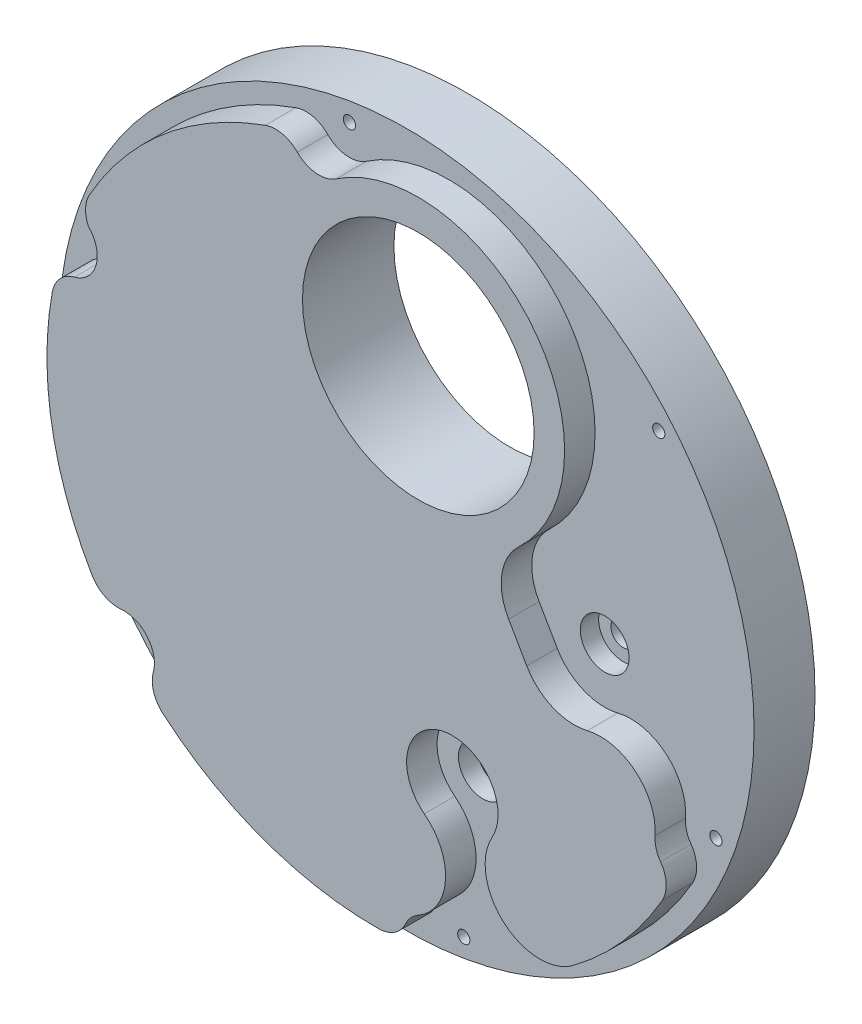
ISO-10303-21;
HEADER;
FILE_DESCRIPTION(('STEP AP214'),'2;1');
FILE_NAME('part.step','',(''),(''),'','','');
FILE_SCHEMA(('AUTOMOTIVE_DESIGN { 1 0 10303 214 1 1 1 1 }'));
ENDSEC;
DATA;
#1=APPLICATION_CONTEXT('core data for automotive mechanical design processes');
#2=APPLICATION_PROTOCOL_DEFINITION('international standard','automotive_design',2000,#1);
#3=PRODUCT_CONTEXT('',#1,'mechanical');
#4=PRODUCT('Part','Part','',(#3));
#5=PRODUCT_RELATED_PRODUCT_CATEGORY('part','',(#4));
#6=PRODUCT_DEFINITION_FORMATION('','',#4);
#7=PRODUCT_DEFINITION_CONTEXT('part definition',#1,'design');
#8=PRODUCT_DEFINITION('design','',#6,#7);
#9=PRODUCT_DEFINITION_SHAPE('','',#8);
#10=(LENGTH_UNIT() NAMED_UNIT(*) SI_UNIT(.MILLI.,.METRE.));
#11=(NAMED_UNIT(*) PLANE_ANGLE_UNIT() SI_UNIT($,.RADIAN.));
#12=(NAMED_UNIT(*) SI_UNIT($,.STERADIAN.) SOLID_ANGLE_UNIT());
#13=UNCERTAINTY_MEASURE_WITH_UNIT(LENGTH_MEASURE(1.E-05),#10,'distance_accuracy_value','');
#14=(GEOMETRIC_REPRESENTATION_CONTEXT(3) GLOBAL_UNCERTAINTY_ASSIGNED_CONTEXT((#13)) GLOBAL_UNIT_ASSIGNED_CONTEXT((#10,
#11,#12)) REPRESENTATION_CONTEXT('',''));
#15=CARTESIAN_POINT('',(0.,0.,0.));
#16=DIRECTION('',(0.,0.,1.));
#17=DIRECTION('',(1.,0.,0.));
#18=AXIS2_PLACEMENT_3D('',#15,#16,#17);
#19=CARTESIAN_POINT('',(12.5,-28.,0.));
#20=DIRECTION('',(0.,0.,1.));
#21=DIRECTION('',(1.,0.,0.));
#22=AXIS2_PLACEMENT_3D('',#19,#20,#21);
#23=CYLINDRICAL_SURFACE('',#22,2.);
#24=CARTESIAN_POINT('',(12.5,-28.,0.));
#25=DIRECTION('',(0.,0.,1.));
#26=DIRECTION('',(1.,0.,0.));
#27=AXIS2_PLACEMENT_3D('',#24,#25,#26);
#28=CIRCLE('',#27,2.);
#29=CARTESIAN_POINT('',(14.5,-28.,0.));
#30=VERTEX_POINT('',#29);
#31=EDGE_CURVE('E377',#30,#30,#28,.T.);
#32=ORIENTED_EDGE('',*,*,#31,.F.);
#33=EDGE_LOOP('',(#32));
#34=FACE_BOUND('',#33,.T.);
#35=CARTESIAN_POINT('',(12.5,-28.,7.));
#36=DIRECTION('',(0.,0.,1.));
#37=DIRECTION('',(1.,0.,0.));
#38=AXIS2_PLACEMENT_3D('',#35,#36,#37);
#39=CIRCLE('',#38,2.);
#40=CARTESIAN_POINT('',(14.5,-28.,7.));
#41=VERTEX_POINT('',#40);
#42=EDGE_CURVE('E37',#41,#41,#39,.F.);
#43=ORIENTED_EDGE('',*,*,#42,.F.);
#44=EDGE_LOOP('',(#43));
#45=FACE_BOUND('',#44,.T.);
#46=ADVANCED_FACE('F33',(#34,#45),#23,.F.);
#47=CARTESIAN_POINT('',(32.5,0.,0.));
#48=DIRECTION('',(0.,0.,1.));
#49=DIRECTION('',(1.,0.,0.));
#50=AXIS2_PLACEMENT_3D('',#47,#48,#49);
#51=CYLINDRICAL_SURFACE('',#50,2.);
#52=CARTESIAN_POINT('',(32.5,0.,0.));
#53=DIRECTION('',(0.,0.,1.));
#54=DIRECTION('',(1.,0.,0.));
#55=AXIS2_PLACEMENT_3D('',#52,#53,#54);
#56=CIRCLE('',#55,2.);
#57=CARTESIAN_POINT('',(34.5,0.,0.));
#58=VERTEX_POINT('',#57);
#59=EDGE_CURVE('E382',#58,#58,#56,.T.);
#60=ORIENTED_EDGE('',*,*,#59,.F.);
#61=EDGE_LOOP('',(#60));
#62=FACE_BOUND('',#61,.T.);
#63=CARTESIAN_POINT('',(32.5,0.,7.));
#64=DIRECTION('',(0.,0.,1.));
#65=DIRECTION('',(1.,0.,0.));
#66=AXIS2_PLACEMENT_3D('',#63,#64,#65);
#67=CIRCLE('',#66,2.);
#68=CARTESIAN_POINT('',(34.5,0.,7.));
#69=VERTEX_POINT('',#68);
#70=EDGE_CURVE('E375',#69,#69,#67,.F.);
#71=ORIENTED_EDGE('',*,*,#70,.F.);
#72=EDGE_LOOP('',(#71));
#73=FACE_BOUND('',#72,.T.);
#74=ADVANCED_FACE('F470',(#62,#73),#51,.F.);
#75=CARTESIAN_POINT('',(0.,0.,10.));
#76=DIRECTION('',(0.,0.,1.));
#77=DIRECTION('',(1.,0.,0.));
#78=AXIS2_PLACEMENT_3D('',#75,#76,#77);
#79=PLANE('',#78);
#80=CARTESIAN_POINT('',(12.5,-28.,10.));
#81=DIRECTION('',(0.,0.,1.));
#82=DIRECTION('',(1.,0.,0.));
#83=AXIS2_PLACEMENT_3D('',#80,#81,#82);
#84=CIRCLE('',#83,4.);
#85=CARTESIAN_POINT('',(16.5,-28.,10.));
#86=VERTEX_POINT('',#85);
#87=EDGE_CURVE('E392',#86,#86,#84,.T.);
#88=ORIENTED_EDGE('',*,*,#87,.F.);
#89=EDGE_LOOP('',(#88));
#90=FACE_BOUND('',#89,.T.);
#91=CARTESIAN_POINT('',(32.5,0.,10.));
#92=DIRECTION('',(0.,0.,1.));
#93=DIRECTION('',(1.,0.,0.));
#94=AXIS2_PLACEMENT_3D('',#91,#92,#93);
#95=CIRCLE('',#94,4.00000000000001);
#96=CARTESIAN_POINT('',(36.5,0.,10.));
#97=VERTEX_POINT('',#96);
#98=EDGE_CURVE('E385',#97,#97,#95,.T.);
#99=ORIENTED_EDGE('',*,*,#98,.F.);
#100=EDGE_LOOP('',(#99));
#101=FACE_BOUND('',#100,.T.);
#102=CARTESIAN_POINT('',(0.,0.,10.));
#103=DIRECTION('',(0.,0.,1.));
#104=DIRECTION('',(1.,0.,0.));
#105=AXIS2_PLACEMENT_3D('',#102,#103,#104);
#106=CIRCLE('',#105,57.);
#107=CARTESIAN_POINT('',(57.,0.,10.));
#108=VERTEX_POINT('',#107);
#109=EDGE_CURVE('E11',#108,#108,#106,.T.);
#110=ORIENTED_EDGE('',*,*,#109,.T.);
#111=EDGE_LOOP('',(#110));
#112=FACE_BOUND('',#111,.T.);
#113=CARTESIAN_POINT('',(-50.7434015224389,18.4690877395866,10.));
#114=DIRECTION('',(0.,0.,1.));
#115=DIRECTION('',(1.,0.,0.));
#116=AXIS2_PLACEMENT_3D('',#113,#114,#115);
#117=CIRCLE('',#116,0.999999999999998);
#118=CARTESIAN_POINT('',(-49.7434015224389,18.4690877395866,10.));
#119=VERTEX_POINT('',#118);
#120=EDGE_CURVE('E366',#119,#119,#117,.T.);
#121=ORIENTED_EDGE('',*,*,#120,.F.);
#122=EDGE_LOOP('',(#121));
#123=FACE_BOUND('',#122,.T.);
#124=CARTESIAN_POINT('',(-9.37700159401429,53.1796186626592,10.));
#125=DIRECTION('',(0.,0.,1.));
#126=DIRECTION('',(1.,0.,0.));
#127=AXIS2_PLACEMENT_3D('',#124,#125,#126);
#128=CIRCLE('',#127,1.);
#129=CARTESIAN_POINT('',(-8.37700159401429,53.1796186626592,10.));
#130=VERTEX_POINT('',#129);
#131=EDGE_CURVE('E360',#130,#130,#128,.T.);
#132=ORIENTED_EDGE('',*,*,#131,.F.);
#133=EDGE_LOOP('',(#132));
#134=FACE_BOUND('',#133,.T.);
#135=CARTESIAN_POINT('',(-41.3663999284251,-34.7105309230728,10.));
#136=DIRECTION('',(0.,0.,1.));
#137=DIRECTION('',(1.,0.,0.));
#138=AXIS2_PLACEMENT_3D('',#135,#136,#137);
#139=CIRCLE('',#138,0.999999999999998);
#140=CARTESIAN_POINT('',(-40.3663999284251,-34.7105309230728,10.));
#141=VERTEX_POINT('',#140);
#142=EDGE_CURVE('E354',#141,#141,#139,.T.);
#143=ORIENTED_EDGE('',*,*,#142,.F.);
#144=EDGE_LOOP('',(#143));
#145=FACE_BOUND('',#144,.T.);
#146=CARTESIAN_POINT('',(9.37700159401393,-53.1796186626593,10.));
#147=DIRECTION('',(0.,0.,1.));
#148=DIRECTION('',(1.,0.,0.));
#149=AXIS2_PLACEMENT_3D('',#146,#147,#148);
#150=CIRCLE('',#149,1.);
#151=CARTESIAN_POINT('',(10.3770015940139,-53.1796186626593,10.));
#152=VERTEX_POINT('',#151);
#153=EDGE_CURVE('E348',#152,#152,#150,.T.);
#154=ORIENTED_EDGE('',*,*,#153,.F.);
#155=EDGE_LOOP('',(#154));
#156=FACE_BOUND('',#155,.T.);
#157=CARTESIAN_POINT('',(50.743401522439,-18.4690877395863,10.));
#158=DIRECTION('',(0.,0.,1.));
#159=DIRECTION('',(1.,0.,0.));
#160=AXIS2_PLACEMENT_3D('',#157,#158,#159);
#161=CIRCLE('',#160,0.999999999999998);
#162=CARTESIAN_POINT('',(51.743401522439,-18.4690877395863,10.));
#163=VERTEX_POINT('',#162);
#164=EDGE_CURVE('E342',#163,#163,#161,.T.);
#165=ORIENTED_EDGE('',*,*,#164,.F.);
#166=EDGE_LOOP('',(#165));
#167=FACE_BOUND('',#166,.T.);
#168=CARTESIAN_POINT('',(41.3663999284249,34.7105309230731,10.));
#169=DIRECTION('',(0.,0.,1.));
#170=DIRECTION('',(1.,0.,0.));
#171=AXIS2_PLACEMENT_3D('',#168,#169,#170);
#172=CIRCLE('',#171,0.999999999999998);
#173=CARTESIAN_POINT('',(42.3663999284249,34.7105309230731,10.));
#174=VERTEX_POINT('',#173);
#175=EDGE_CURVE('E338',#174,#174,#172,.T.);
#176=ORIENTED_EDGE('',*,*,#175,.F.);
#177=EDGE_LOOP('',(#176));
#178=FACE_BOUND('',#177,.T.);
#179=CARTESIAN_POINT('',(-42.6661219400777,24.0956850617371,10.));
#180=DIRECTION('',(0.,0.,1.));
#181=DIRECTION('',(1.,0.,0.));
#182=AXIS2_PLACEMENT_3D('',#179,#180,#181);
#183=CIRCLE('',#182,4.99999999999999);
#184=CARTESIAN_POINT('',(-47.0198078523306,26.5544284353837,10.));
#185=VERTEX_POINT('',#184);
#186=CARTESIAN_POINT('',(-47.2078676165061,22.0046216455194,10.));
#187=VERTEX_POINT('',#186);
#188=EDGE_CURVE('E230',#185,#187,#183,.T.);
#189=ORIENTED_EDGE('',*,*,#188,.F.);
#190=CARTESIAN_POINT('',(0.,0.,10.));
#191=DIRECTION('',(0.,0.,1.));
#192=DIRECTION('',(1.,0.,0.));
#193=AXIS2_PLACEMENT_3D('',#190,#191,#192);
#194=CIRCLE('',#193,54.);
#195=CARTESIAN_POINT('',(-18.1655835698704,50.8528423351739,10.));
#196=VERTEX_POINT('',#195);
#197=EDGE_CURVE('E227',#196,#185,#194,.T.);
#198=ORIENTED_EDGE('',*,*,#197,.F.);
#199=CARTESIAN_POINT('',(-16.4835850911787,46.1442458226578,10.));
#200=DIRECTION('',(0.,0.,1.));
#201=DIRECTION('',(-1.,0.,0.));
#202=AXIS2_PLACEMENT_3D('',#199,#200,#201);
#203=CIRCLE('',#202,5.);
#204=CARTESIAN_POINT('',(-12.9302933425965,49.6619322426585,10.));
#205=VERTEX_POINT('',#204);
#206=EDGE_CURVE('E132',#205,#196,#203,.T.);
#207=ORIENTED_EDGE('',*,*,#206,.F.);
#208=CARTESIAN_POINT('',(-9.37700159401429,53.1796186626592,10.));
#209=DIRECTION('',(0.,0.,-1.));
#210=DIRECTION('',(1.,0.,0.));
#211=AXIS2_PLACEMENT_3D('',#208,#209,#210);
#212=CIRCLE('',#211,4.99999999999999);
#213=CARTESIAN_POINT('',(-6.56735730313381,49.0436908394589,10.));
#214=VERTEX_POINT('',#213);
#215=EDGE_CURVE('E272',#214,#205,#212,.T.);
#216=ORIENTED_EDGE('',*,*,#215,.F.);
#217=CARTESIAN_POINT('',(6.9189352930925,29.1912372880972,10.));
#218=DIRECTION('',(0.,0.,1.));
#219=DIRECTION('',(-1.,0.,0.));
#220=AXIS2_PLACEMENT_3D('',#217,#218,#219);
#221=CIRCLE('',#220,24.);
#222=CARTESIAN_POINT('',(23.3603992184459,11.7075802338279,10.));
#223=VERTEX_POINT('',#222);
#224=EDGE_CURVE('E216',#223,#214,#221,.T.);
#225=ORIENTED_EDGE('',*,*,#224,.F.);
#226=CARTESIAN_POINT('',(29.5259481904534,5.15120883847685,10.));
#227=DIRECTION('',(0.,0.,-1.));
#228=DIRECTION('',(1.,0.,0.));
#229=AXIS2_PLACEMENT_3D('',#226,#227,#228);
#230=CIRCLE('',#229,9.);
#231=CARTESIAN_POINT('',(21.7317195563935,0.651208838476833,10.));
#232=VERTEX_POINT('',#231);
#233=EDGE_CURVE('E269',#232,#223,#230,.T.);
#234=ORIENTED_EDGE('',*,*,#233,.F.);
#235=DIRECTION('',(-0.500000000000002,0.866025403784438,0.));
#236=VECTOR('',#235,1.);
#237=CARTESIAN_POINT('',(21.7317195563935,0.65120883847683,10.));
#238=LINE('',#237,#236);
#239=CARTESIAN_POINT('',(24.7057713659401,-4.50000000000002,10.));
#240=VERTEX_POINT('',#239);
#241=EDGE_CURVE('E267',#240,#232,#238,.T.);
#242=ORIENTED_EDGE('',*,*,#241,.F.);
#243=CARTESIAN_POINT('',(32.5,0.,10.));
#244=DIRECTION('',(0.,0.,-1.));
#245=DIRECTION('',(1.,0.,0.));
#246=AXIS2_PLACEMENT_3D('',#243,#244,#245);
#247=CIRCLE('',#246,9.);
#248=CARTESIAN_POINT('',(34.639043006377,-8.74211044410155,10.));
#249=VERTEX_POINT('',#248);
#250=EDGE_CURVE('E265',#249,#240,#247,.T.);
#251=ORIENTED_EDGE('',*,*,#250,.F.);
#252=CARTESIAN_POINT('',(36.7780860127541,-17.4842208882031,10.));
#253=DIRECTION('',(0.,0.,1.));
#254=DIRECTION('',(-1.,0.,0.));
#255=AXIS2_PLACEMENT_3D('',#252,#253,#254);
#256=CIRCLE('',#255,8.99999999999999);
#257=CARTESIAN_POINT('',(45.7557888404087,-18.117349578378,10.));
#258=VERTEX_POINT('',#257);
#259=EDGE_CURVE('E263',#258,#249,#256,.T.);
#260=ORIENTED_EDGE('',*,*,#259,.F.);
#261=CARTESIAN_POINT('',(50.743401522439,-18.4690877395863,10.));
#262=DIRECTION('',(0.,0.,-1.));
#263=DIRECTION('',(1.,0.,0.));
#264=AXIS2_PLACEMENT_3D('',#261,#262,#263);
#265=CIRCLE('',#264,5.00000000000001);
#266=CARTESIAN_POINT('',(46.6621340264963,-21.3575571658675,10.));
#267=VERTEX_POINT('',#266);
#268=EDGE_CURVE('E261',#267,#258,#265,.T.);
#269=ORIENTED_EDGE('',*,*,#268,.F.);
#270=CARTESIAN_POINT('',(42.5808665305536,-24.2460265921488,10.));
#271=DIRECTION('',(0.,0.,1.));
#272=DIRECTION('',(-1.,0.,0.));
#273=AXIS2_PLACEMENT_3D('',#270,#271,#272);
#274=CIRCLE('',#273,5.);
#275=CARTESIAN_POINT('',(46.9258529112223,-26.7201109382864,10.));
#276=VERTEX_POINT('',#275);
#277=EDGE_CURVE('E259',#276,#267,#274,.T.);
#278=ORIENTED_EDGE('',*,*,#277,.F.);
#279=CARTESIAN_POINT('',(0.,0.,10.));
#280=DIRECTION('',(0.,0.,1.));
#281=DIRECTION('',(1.,0.,0.));
#282=AXIS2_PLACEMENT_3D('',#279,#280,#281);
#283=CIRCLE('',#282,54.);
#284=CARTESIAN_POINT('',(32.2576188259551,-43.3064201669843,10.));
#285=VERTEX_POINT('',#284);
#286=EDGE_CURVE('E257',#285,#276,#283,.T.);
#287=ORIENTED_EDGE('',*,*,#286,.F.);
#288=CARTESIAN_POINT('',(26.8813490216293,-36.0886834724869,10.));
#289=DIRECTION('',(0.,0.,1.));
#290=DIRECTION('',(-1.,0.,0.));
#291=AXIS2_PLACEMENT_3D('',#288,#289,#290);
#292=CIRCLE('',#291,8.99999999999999);
#293=CARTESIAN_POINT('',(19.0369768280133,-31.6766743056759,10.));
#294=VERTEX_POINT('',#293);
#295=EDGE_CURVE('E255',#294,#285,#292,.T.);
#296=ORIENTED_EDGE('',*,*,#295,.F.);
#297=CARTESIAN_POINT('',(12.5,-28.,10.));
#298=DIRECTION('',(0.,0.,-1.));
#299=DIRECTION('',(1.,0.,0.));
#300=AXIS2_PLACEMENT_3D('',#297,#298,#299);
#301=CIRCLE('',#300,7.5);
#302=CARTESIAN_POINT('',(7.90720749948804,-33.9292712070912,10.));
#303=VERTEX_POINT('',#302);
#304=EDGE_CURVE('E253',#303,#294,#301,.T.);
#305=ORIENTED_EDGE('',*,*,#304,.F.);
#306=CARTESIAN_POINT('',(2.39585649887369,-41.0443966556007,10.));
#307=DIRECTION('',(0.,0.,1.));
#308=DIRECTION('',(-1.,0.,0.));
#309=AXIS2_PLACEMENT_3D('',#306,#307,#308);
#310=CIRCLE('',#309,9.);
#311=CARTESIAN_POINT('',(6.8837354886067,-48.8456108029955,10.));
#312=VERTEX_POINT('',#311);
#313=EDGE_CURVE('E251',#312,#303,#310,.T.);
#314=ORIENTED_EDGE('',*,*,#313,.F.);
#315=CARTESIAN_POINT('',(9.37700159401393,-53.1796186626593,10.));
#316=DIRECTION('',(0.,0.,-1.));
#317=DIRECTION('',(1.,0.,0.));
#318=AXIS2_PLACEMENT_3D('',#315,#316,#317);
#319=CIRCLE('',#318,5.);
#320=CARTESIAN_POINT('',(4.83487994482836,-51.0893720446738,10.));
#321=VERTEX_POINT('',#320);
#322=EDGE_CURVE('E249',#321,#312,#319,.T.);
#323=ORIENTED_EDGE('',*,*,#322,.F.);
#324=CARTESIAN_POINT('',(0.29275829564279,-48.9991254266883,10.));
#325=DIRECTION('',(0.,0.,1.));
#326=DIRECTION('',(-1.,0.,0.));
#327=AXIS2_PLACEMENT_3D('',#324,#325,#326);
#328=CIRCLE('',#327,4.99999999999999);
#329=CARTESIAN_POINT('',(0.322631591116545,-53.9990361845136,10.));
#330=VERTEX_POINT('',#329);
#331=EDGE_CURVE('E247',#330,#321,#328,.T.);
#332=ORIENTED_EDGE('',*,*,#331,.F.);
#333=CARTESIAN_POINT('',(0.,0.,10.));
#334=DIRECTION('',(0.,0.,1.));
#335=DIRECTION('',(1.,0.,0.));
#336=AXIS2_PLACEMENT_3D('',#333,#334,#335);
#337=CIRCLE('',#336,54.);
#338=CARTESIAN_POINT('',(-34.9570615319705,-41.1582780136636,10.));
#339=VERTEX_POINT('',#338);
#340=EDGE_CURVE('E245',#339,#330,#337,.T.);
#341=ORIENTED_EDGE('',*,*,#340,.F.);
#342=CARTESIAN_POINT('',(-31.7202965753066,-37.3473263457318,10.));
#343=DIRECTION('',(0.,0.,1.));
#344=DIRECTION('',(1.,0.,0.));
#345=AXIS2_PLACEMENT_3D('',#342,#343,#344);
#346=CIRCLE('',#345,5.);
#347=CARTESIAN_POINT('',(-36.5433482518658,-36.0289286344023,10.));
#348=VERTEX_POINT('',#347);
#349=EDGE_CURVE('E243',#348,#339,#346,.T.);
#350=ORIENTED_EDGE('',*,*,#349,.F.);
#351=CARTESIAN_POINT('',(-41.3663999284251,-34.7105309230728,10.));
#352=DIRECTION('',(0.,0.,-1.));
#353=DIRECTION('',(-1.,0.,0.));
#354=AXIS2_PLACEMENT_3D('',#351,#352,#353);
#355=CIRCLE('',#354,5.);
#356=CARTESIAN_POINT('',(-41.8272540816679,-29.7318148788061,10.));
#357=VERTEX_POINT('',#356);
#358=EDGE_CURVE('E241',#357,#348,#355,.T.);
#359=ORIENTED_EDGE('',*,*,#358,.F.);
#360=CARTESIAN_POINT('',(-42.2881082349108,-24.7530988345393,10.));
#361=DIRECTION('',(0.,0.,1.));
#362=DIRECTION('',(1.,0.,0.));
#363=AXIS2_PLACEMENT_3D('',#360,#361,#362);
#364=CIRCLE('',#363,5.);
#365=CARTESIAN_POINT('',(-46.6032213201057,-27.278925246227,10.));
#366=VERTEX_POINT('',#365);
#367=EDGE_CURVE('E239',#366,#357,#364,.T.);
#368=ORIENTED_EDGE('',*,*,#367,.F.);
#369=CARTESIAN_POINT('',(0.,0.,10.));
#370=DIRECTION('',(0.,0.,1.));
#371=DIRECTION('',(1.,0.,0.));
#372=AXIS2_PLACEMENT_3D('',#369,#370,#371);
#373=CIRCLE('',#372,54.);
#374=CARTESIAN_POINT('',(-53.1226451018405,9.69456432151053,10.));
#375=VERTEX_POINT('',#374);
#376=EDGE_CURVE('E237',#375,#366,#373,.T.);
#377=ORIENTED_EDGE('',*,*,#376,.F.);
#378=CARTESIAN_POINT('',(-48.2038816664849,8.79691947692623,10.));
#379=DIRECTION('',(0.,0.,1.));
#380=DIRECTION('',(1.,0.,0.));
#381=AXIS2_PLACEMENT_3D('',#378,#379,#380);
#382=CIRCLE('',#381,5.);
#383=CARTESIAN_POINT('',(-49.4736415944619,13.6330036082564,10.));
#384=VERTEX_POINT('',#383);
#385=EDGE_CURVE('E235',#384,#375,#382,.T.);
#386=ORIENTED_EDGE('',*,*,#385,.F.);
#387=CARTESIAN_POINT('',(-50.7434015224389,18.4690877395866,10.));
#388=DIRECTION('',(0.,0.,-1.));
#389=DIRECTION('',(-1.,0.,0.));
#390=AXIS2_PLACEMENT_3D('',#387,#388,#389);
#391=CIRCLE('',#390,5.);
#392=EDGE_CURVE('E233',#187,#384,#391,.T.);
#393=ORIENTED_EDGE('',*,*,#392,.F.);
#394=EDGE_LOOP('',(#189,#198,#207,#216,#225,#234,#242,#251,#260,#269,#278,#287,#296,#305,#314,
#323,#332,#341,#350,#359,#368,#377,#386,#393));
#395=FACE_BOUND('',#394,.T.);
#396=ADVANCED_FACE('F451',(#90,#101,#112,#123,#134,#145,#156,#167,#178,#395),#79,.T.);
#397=CARTESIAN_POINT('',(0.,0.,10.));
#398=DIRECTION('',(0.,0.,-1.));
#399=DIRECTION('',(-1.,0.,0.));
#400=AXIS2_PLACEMENT_3D('',#397,#398,#399);
#401=CYLINDRICAL_SURFACE('',#400,57.);
#402=ORIENTED_EDGE('',*,*,#109,.F.);
#403=EDGE_LOOP('',(#402));
#404=FACE_BOUND('',#403,.T.);
#405=CARTESIAN_POINT('',(0.,0.,0.));
#406=DIRECTION('',(0.,0.,1.));
#407=DIRECTION('',(1.,0.,0.));
#408=AXIS2_PLACEMENT_3D('',#405,#406,#407);
#409=CIRCLE('',#408,57.);
#410=CARTESIAN_POINT('',(57.,0.,0.));
#411=VERTEX_POINT('',#410);
#412=EDGE_CURVE('E42',#411,#411,#409,.T.);
#413=ORIENTED_EDGE('',*,*,#412,.T.);
#414=EDGE_LOOP('',(#413));
#415=FACE_BOUND('',#414,.T.);
#416=ADVANCED_FACE('F35',(#404,#415),#401,.T.);
#417=CARTESIAN_POINT('',(0.,0.,0.));
#418=DIRECTION('',(0.,0.,1.));
#419=DIRECTION('',(1.,0.,0.));
#420=AXIS2_PLACEMENT_3D('',#417,#418,#419);
#421=PLANE('',#420);
#422=ORIENTED_EDGE('',*,*,#31,.T.);
#423=EDGE_LOOP('',(#422));
#424=FACE_BOUND('',#423,.T.);
#425=ORIENTED_EDGE('',*,*,#59,.T.);
#426=EDGE_LOOP('',(#425));
#427=FACE_BOUND('',#426,.T.);
#428=CARTESIAN_POINT('',(6.9189352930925,29.1912372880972,0.));
#429=DIRECTION('',(0.,0.,1.));
#430=DIRECTION('',(1.,0.,0.));
#431=AXIS2_PLACEMENT_3D('',#428,#429,#430);
#432=CIRCLE('',#431,19.);
#433=CARTESIAN_POINT('',(25.9189352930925,29.1912372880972,0.));
#434=VERTEX_POINT('',#433);
#435=EDGE_CURVE('E231',#434,#434,#432,.T.);
#436=ORIENTED_EDGE('',*,*,#435,.T.);
#437=EDGE_LOOP('',(#436));
#438=FACE_BOUND('',#437,.T.);
#439=CARTESIAN_POINT('',(41.3663999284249,34.7105309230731,0.));
#440=DIRECTION('',(0.,0.,1.));
#441=DIRECTION('',(1.,0.,0.));
#442=AXIS2_PLACEMENT_3D('',#439,#440,#441);
#443=CIRCLE('',#442,0.999999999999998);
#444=CARTESIAN_POINT('',(42.3663999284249,34.7105309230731,0.));
#445=VERTEX_POINT('',#444);
#446=EDGE_CURVE('E339',#445,#445,#443,.T.);
#447=ORIENTED_EDGE('',*,*,#446,.T.);
#448=EDGE_LOOP('',(#447));
#449=FACE_BOUND('',#448,.T.);
#450=CARTESIAN_POINT('',(50.743401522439,-18.4690877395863,0.));
#451=DIRECTION('',(0.,0.,1.));
#452=DIRECTION('',(1.,0.,0.));
#453=AXIS2_PLACEMENT_3D('',#450,#451,#452);
#454=CIRCLE('',#453,0.999999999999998);
#455=CARTESIAN_POINT('',(51.743401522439,-18.4690877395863,0.));
#456=VERTEX_POINT('',#455);
#457=EDGE_CURVE('E345',#456,#456,#454,.T.);
#458=ORIENTED_EDGE('',*,*,#457,.T.);
#459=EDGE_LOOP('',(#458));
#460=FACE_BOUND('',#459,.T.);
#461=CARTESIAN_POINT('',(9.37700159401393,-53.1796186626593,0.));
#462=DIRECTION('',(0.,0.,1.));
#463=DIRECTION('',(1.,0.,0.));
#464=AXIS2_PLACEMENT_3D('',#461,#462,#463);
#465=CIRCLE('',#464,1.);
#466=CARTESIAN_POINT('',(10.3770015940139,-53.1796186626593,0.));
#467=VERTEX_POINT('',#466);
#468=EDGE_CURVE('E351',#467,#467,#465,.T.);
#469=ORIENTED_EDGE('',*,*,#468,.T.);
#470=EDGE_LOOP('',(#469));
#471=FACE_BOUND('',#470,.T.);
#472=CARTESIAN_POINT('',(-41.3663999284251,-34.7105309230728,0.));
#473=DIRECTION('',(0.,0.,1.));
#474=DIRECTION('',(1.,0.,0.));
#475=AXIS2_PLACEMENT_3D('',#472,#473,#474);
#476=CIRCLE('',#475,0.999999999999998);
#477=CARTESIAN_POINT('',(-40.3663999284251,-34.7105309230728,0.));
#478=VERTEX_POINT('',#477);
#479=EDGE_CURVE('E357',#478,#478,#476,.T.);
#480=ORIENTED_EDGE('',*,*,#479,.T.);
#481=EDGE_LOOP('',(#480));
#482=FACE_BOUND('',#481,.T.);
#483=CARTESIAN_POINT('',(-9.37700159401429,53.1796186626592,0.));
#484=DIRECTION('',(0.,0.,1.));
#485=DIRECTION('',(1.,0.,0.));
#486=AXIS2_PLACEMENT_3D('',#483,#484,#485);
#487=CIRCLE('',#486,1.);
#488=CARTESIAN_POINT('',(-8.37700159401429,53.1796186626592,0.));
#489=VERTEX_POINT('',#488);
#490=EDGE_CURVE('E363',#489,#489,#487,.T.);
#491=ORIENTED_EDGE('',*,*,#490,.T.);
#492=EDGE_LOOP('',(#491));
#493=FACE_BOUND('',#492,.T.);
#494=CARTESIAN_POINT('',(-50.7434015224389,18.4690877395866,0.));
#495=DIRECTION('',(0.,0.,1.));
#496=DIRECTION('',(1.,0.,0.));
#497=AXIS2_PLACEMENT_3D('',#494,#495,#496);
#498=CIRCLE('',#497,0.999999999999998);
#499=CARTESIAN_POINT('',(-49.7434015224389,18.4690877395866,0.));
#500=VERTEX_POINT('',#499);
#501=EDGE_CURVE('E369',#500,#500,#498,.T.);
#502=ORIENTED_EDGE('',*,*,#501,.T.);
#503=EDGE_LOOP('',(#502));
#504=FACE_BOUND('',#503,.T.);
#505=ORIENTED_EDGE('',*,*,#412,.F.);
#506=EDGE_LOOP('',(#505));
#507=FACE_BOUND('',#506,.T.);
#508=ADVANCED_FACE('F494',(#424,#427,#438,#449,#460,#471,#482,#493,#504,#507),#421,.F.);
#509=CARTESIAN_POINT('',(-50.7434015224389,18.4690877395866,0.));
#510=DIRECTION('',(0.,0.,1.));
#511=DIRECTION('',(1.,0.,0.));
#512=AXIS2_PLACEMENT_3D('',#509,#510,#511);
#513=CYLINDRICAL_SURFACE('',#512,0.999999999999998);
#514=ORIENTED_EDGE('',*,*,#501,.F.);
#515=EDGE_LOOP('',(#514));
#516=FACE_BOUND('',#515,.T.);
#517=ORIENTED_EDGE('',*,*,#120,.T.);
#518=EDGE_LOOP('',(#517));
#519=FACE_BOUND('',#518,.T.);
#520=ADVANCED_FACE('F497',(#516,#519),#513,.F.);
#521=CARTESIAN_POINT('',(-9.37700159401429,53.1796186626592,0.));
#522=DIRECTION('',(0.,0.,1.));
#523=DIRECTION('',(1.,0.,0.));
#524=AXIS2_PLACEMENT_3D('',#521,#522,#523);
#525=CYLINDRICAL_SURFACE('',#524,1.);
#526=ORIENTED_EDGE('',*,*,#490,.F.);
#527=EDGE_LOOP('',(#526));
#528=FACE_BOUND('',#527,.T.);
#529=ORIENTED_EDGE('',*,*,#131,.T.);
#530=EDGE_LOOP('',(#529));
#531=FACE_BOUND('',#530,.T.);
#532=ADVANCED_FACE('F557',(#528,#531),#525,.F.);
#533=CARTESIAN_POINT('',(-41.3663999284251,-34.7105309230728,0.));
#534=DIRECTION('',(0.,0.,1.));
#535=DIRECTION('',(1.,0.,0.));
#536=AXIS2_PLACEMENT_3D('',#533,#534,#535);
#537=CYLINDRICAL_SURFACE('',#536,0.999999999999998);
#538=ORIENTED_EDGE('',*,*,#479,.F.);
#539=EDGE_LOOP('',(#538));
#540=FACE_BOUND('',#539,.T.);
#541=ORIENTED_EDGE('',*,*,#142,.T.);
#542=EDGE_LOOP('',(#541));
#543=FACE_BOUND('',#542,.T.);
#544=ADVANCED_FACE('F553',(#540,#543),#537,.F.);
#545=CARTESIAN_POINT('',(9.37700159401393,-53.1796186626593,0.));
#546=DIRECTION('',(0.,0.,1.));
#547=DIRECTION('',(1.,0.,0.));
#548=AXIS2_PLACEMENT_3D('',#545,#546,#547);
#549=CYLINDRICAL_SURFACE('',#548,1.);
#550=ORIENTED_EDGE('',*,*,#468,.F.);
#551=EDGE_LOOP('',(#550));
#552=FACE_BOUND('',#551,.T.);
#553=ORIENTED_EDGE('',*,*,#153,.T.);
#554=EDGE_LOOP('',(#553));
#555=FACE_BOUND('',#554,.T.);
#556=ADVANCED_FACE('F546',(#552,#555),#549,.F.);
#557=CARTESIAN_POINT('',(50.743401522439,-18.4690877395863,0.));
#558=DIRECTION('',(0.,0.,1.));
#559=DIRECTION('',(1.,0.,0.));
#560=AXIS2_PLACEMENT_3D('',#557,#558,#559);
#561=CYLINDRICAL_SURFACE('',#560,0.999999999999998);
#562=ORIENTED_EDGE('',*,*,#457,.F.);
#563=EDGE_LOOP('',(#562));
#564=FACE_BOUND('',#563,.T.);
#565=ORIENTED_EDGE('',*,*,#164,.T.);
#566=EDGE_LOOP('',(#565));
#567=FACE_BOUND('',#566,.T.);
#568=ADVANCED_FACE('F537',(#564,#567),#561,.F.);
#569=CARTESIAN_POINT('',(41.3663999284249,34.7105309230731,0.));
#570=DIRECTION('',(0.,0.,1.));
#571=DIRECTION('',(1.,0.,0.));
#572=AXIS2_PLACEMENT_3D('',#569,#570,#571);
#573=CYLINDRICAL_SURFACE('',#572,0.999999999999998);
#574=ORIENTED_EDGE('',*,*,#446,.F.);
#575=EDGE_LOOP('',(#574));
#576=FACE_BOUND('',#575,.T.);
#577=ORIENTED_EDGE('',*,*,#175,.T.);
#578=EDGE_LOOP('',(#577));
#579=FACE_BOUND('',#578,.T.);
#580=ADVANCED_FACE('F535',(#576,#579),#573,.F.);
#581=CARTESIAN_POINT('',(0.,0.,15.));
#582=DIRECTION('',(0.,0.,-1.));
#583=DIRECTION('',(-1.,0.,0.));
#584=AXIS2_PLACEMENT_3D('',#581,#582,#583);
#585=CYLINDRICAL_SURFACE('',#584,54.);
#586=ORIENTED_EDGE('',*,*,#197,.T.);
#587=DIRECTION('',(0.,0.,-1.));
#588=VECTOR('',#587,1.);
#589=CARTESIAN_POINT('',(-47.0198078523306,26.5544284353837,15.));
#590=LINE('',#589,#588);
#591=CARTESIAN_POINT('',(-47.0198078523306,26.5544284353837,15.));
#592=VERTEX_POINT('',#591);
#593=EDGE_CURVE('E336',#592,#185,#590,.T.);
#594=ORIENTED_EDGE('',*,*,#593,.F.);
#595=CARTESIAN_POINT('',(0.,0.,15.));
#596=DIRECTION('',(0.,0.,1.));
#597=DIRECTION('',(1.,0.,0.));
#598=AXIS2_PLACEMENT_3D('',#595,#596,#597);
#599=CIRCLE('',#598,54.);
#600=CARTESIAN_POINT('',(-18.1655835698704,50.8528423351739,15.));
#601=VERTEX_POINT('',#600);
#602=EDGE_CURVE('E275',#601,#592,#599,.T.);
#603=ORIENTED_EDGE('',*,*,#602,.F.);
#604=DIRECTION('',(0.,0.,-1.));
#605=VECTOR('',#604,1.);
#606=CARTESIAN_POINT('',(-18.1655835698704,50.8528423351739,15.));
#607=LINE('',#606,#605);
#608=EDGE_CURVE('E223',#601,#196,#607,.T.);
#609=ORIENTED_EDGE('',*,*,#608,.T.);
#610=EDGE_LOOP('',(#586,#594,#603,#609));
#611=FACE_BOUND('',#610,.T.);
#612=ADVANCED_FACE('F456',(#611),#585,.T.);
#613=CARTESIAN_POINT('',(-42.6661219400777,24.0956850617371,15.));
#614=DIRECTION('',(0.,0.,-1.));
#615=DIRECTION('',(-1.,0.,0.));
#616=AXIS2_PLACEMENT_3D('',#613,#614,#615);
#617=CYLINDRICAL_SURFACE('',#616,4.99999999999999);
#618=ORIENTED_EDGE('',*,*,#188,.T.);
#619=DIRECTION('',(0.,0.,-1.));
#620=VECTOR('',#619,1.);
#621=CARTESIAN_POINT('',(-47.2078676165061,22.0046216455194,15.));
#622=LINE('',#621,#620);
#623=CARTESIAN_POINT('',(-47.2078676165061,22.0046216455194,15.));
#624=VERTEX_POINT('',#623);
#625=EDGE_CURVE('E333',#624,#187,#622,.T.);
#626=ORIENTED_EDGE('',*,*,#625,.F.);
#627=CARTESIAN_POINT('',(-42.6661219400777,24.0956850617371,15.));
#628=DIRECTION('',(0.,0.,1.));
#629=DIRECTION('',(1.,0.,0.));
#630=AXIS2_PLACEMENT_3D('',#627,#628,#629);
#631=CIRCLE('',#630,4.99999999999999);
#632=EDGE_CURVE('E140',#592,#624,#631,.T.);
#633=ORIENTED_EDGE('',*,*,#632,.F.);
#634=ORIENTED_EDGE('',*,*,#593,.T.);
#635=EDGE_LOOP('',(#618,#626,#633,#634));
#636=FACE_BOUND('',#635,.T.);
#637=ADVANCED_FACE('F544',(#636),#617,.T.);
#638=CARTESIAN_POINT('',(-50.7434015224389,18.4690877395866,15.));
#639=DIRECTION('',(0.,0.,-1.));
#640=DIRECTION('',(-1.,0.,0.));
#641=AXIS2_PLACEMENT_3D('',#638,#639,#640);
#642=CYLINDRICAL_SURFACE('',#641,5.);
#643=ORIENTED_EDGE('',*,*,#392,.T.);
#644=DIRECTION('',(0.,0.,-1.));
#645=VECTOR('',#644,1.);
#646=CARTESIAN_POINT('',(-49.4736415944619,13.6330036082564,15.));
#647=LINE('',#646,#645);
#648=CARTESIAN_POINT('',(-49.4736415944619,13.6330036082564,15.));
#649=VERTEX_POINT('',#648);
#650=EDGE_CURVE('E330',#649,#384,#647,.T.);
#651=ORIENTED_EDGE('',*,*,#650,.F.);
#652=CARTESIAN_POINT('',(-50.7434015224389,18.4690877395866,15.));
#653=DIRECTION('',(0.,0.,-1.));
#654=DIRECTION('',(-1.,0.,0.));
#655=AXIS2_PLACEMENT_3D('',#652,#653,#654);
#656=CIRCLE('',#655,5.);
#657=EDGE_CURVE('E404',#624,#649,#656,.T.);
#658=ORIENTED_EDGE('',*,*,#657,.F.);
#659=ORIENTED_EDGE('',*,*,#625,.T.);
#660=EDGE_LOOP('',(#643,#651,#658,#659));
#661=FACE_BOUND('',#660,.T.);
#662=ADVANCED_FACE('F605',(#661),#642,.F.);
#663=CARTESIAN_POINT('',(-48.2038816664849,8.79691947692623,15.));
#664=DIRECTION('',(0.,0.,-1.));
#665=DIRECTION('',(-1.,0.,0.));
#666=AXIS2_PLACEMENT_3D('',#663,#664,#665);
#667=CYLINDRICAL_SURFACE('',#666,5.);
#668=ORIENTED_EDGE('',*,*,#385,.T.);
#669=DIRECTION('',(0.,0.,-1.));
#670=VECTOR('',#669,1.);
#671=CARTESIAN_POINT('',(-53.1226451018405,9.69456432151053,15.));
#672=LINE('',#671,#670);
#673=CARTESIAN_POINT('',(-53.1226451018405,9.69456432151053,15.));
#674=VERTEX_POINT('',#673);
#675=EDGE_CURVE('E327',#674,#375,#672,.T.);
#676=ORIENTED_EDGE('',*,*,#675,.F.);
#677=CARTESIAN_POINT('',(-48.2038816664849,8.79691947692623,15.));
#678=DIRECTION('',(0.,0.,1.));
#679=DIRECTION('',(1.,0.,0.));
#680=AXIS2_PLACEMENT_3D('',#677,#678,#679);
#681=CIRCLE('',#680,5.);
#682=EDGE_CURVE('E406',#649,#674,#681,.T.);
#683=ORIENTED_EDGE('',*,*,#682,.F.);
#684=ORIENTED_EDGE('',*,*,#650,.T.);
#685=EDGE_LOOP('',(#668,#676,#683,#684));
#686=FACE_BOUND('',#685,.T.);
#687=ADVANCED_FACE('F613',(#686),#667,.T.);
#688=CARTESIAN_POINT('',(0.,0.,15.));
#689=DIRECTION('',(0.,0.,-1.));
#690=DIRECTION('',(-1.,0.,0.));
#691=AXIS2_PLACEMENT_3D('',#688,#689,#690);
#692=CYLINDRICAL_SURFACE('',#691,54.);
#693=ORIENTED_EDGE('',*,*,#376,.T.);
#694=DIRECTION('',(0.,0.,-1.));
#695=VECTOR('',#694,1.);
#696=CARTESIAN_POINT('',(-46.6032213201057,-27.278925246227,15.));
#697=LINE('',#696,#695);
#698=CARTESIAN_POINT('',(-46.6032213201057,-27.278925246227,15.));
#699=VERTEX_POINT('',#698);
#700=EDGE_CURVE('E324',#699,#366,#697,.T.);
#701=ORIENTED_EDGE('',*,*,#700,.F.);
#702=CARTESIAN_POINT('',(0.,0.,15.));
#703=DIRECTION('',(0.,0.,1.));
#704=DIRECTION('',(1.,0.,0.));
#705=AXIS2_PLACEMENT_3D('',#702,#703,#704);
#706=CIRCLE('',#705,54.);
#707=EDGE_CURVE('E408',#674,#699,#706,.T.);
#708=ORIENTED_EDGE('',*,*,#707,.F.);
#709=ORIENTED_EDGE('',*,*,#675,.T.);
#710=EDGE_LOOP('',(#693,#701,#708,#709));
#711=FACE_BOUND('',#710,.T.);
#712=ADVANCED_FACE('F623',(#711),#692,.T.);
#713=CARTESIAN_POINT('',(-42.2881082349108,-24.7530988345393,15.));
#714=DIRECTION('',(0.,0.,-1.));
#715=DIRECTION('',(-1.,0.,0.));
#716=AXIS2_PLACEMENT_3D('',#713,#714,#715);
#717=CYLINDRICAL_SURFACE('',#716,5.);
#718=ORIENTED_EDGE('',*,*,#367,.T.);
#719=DIRECTION('',(0.,0.,-1.));
#720=VECTOR('',#719,1.);
#721=CARTESIAN_POINT('',(-41.8272540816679,-29.7318148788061,15.));
#722=LINE('',#721,#720);
#723=CARTESIAN_POINT('',(-41.8272540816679,-29.7318148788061,15.));
#724=VERTEX_POINT('',#723);
#725=EDGE_CURVE('E321',#724,#357,#722,.T.);
#726=ORIENTED_EDGE('',*,*,#725,.F.);
#727=CARTESIAN_POINT('',(-42.2881082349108,-24.7530988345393,15.));
#728=DIRECTION('',(0.,0.,1.));
#729=DIRECTION('',(1.,0.,0.));
#730=AXIS2_PLACEMENT_3D('',#727,#728,#729);
#731=CIRCLE('',#730,5.);
#732=EDGE_CURVE('E410',#699,#724,#731,.T.);
#733=ORIENTED_EDGE('',*,*,#732,.F.);
#734=ORIENTED_EDGE('',*,*,#700,.T.);
#735=EDGE_LOOP('',(#718,#726,#733,#734));
#736=FACE_BOUND('',#735,.T.);
#737=ADVANCED_FACE('F633',(#736),#717,.T.);
#738=CARTESIAN_POINT('',(-41.3663999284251,-34.7105309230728,15.));
#739=DIRECTION('',(0.,0.,-1.));
#740=DIRECTION('',(-1.,0.,0.));
#741=AXIS2_PLACEMENT_3D('',#738,#739,#740);
#742=CYLINDRICAL_SURFACE('',#741,5.);
#743=ORIENTED_EDGE('',*,*,#358,.T.);
#744=DIRECTION('',(0.,0.,-1.));
#745=VECTOR('',#744,1.);
#746=CARTESIAN_POINT('',(-36.5433482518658,-36.0289286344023,15.));
#747=LINE('',#746,#745);
#748=CARTESIAN_POINT('',(-36.5433482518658,-36.0289286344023,15.));
#749=VERTEX_POINT('',#748);
#750=EDGE_CURVE('E318',#749,#348,#747,.T.);
#751=ORIENTED_EDGE('',*,*,#750,.F.);
#752=CARTESIAN_POINT('',(-41.3663999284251,-34.7105309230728,15.));
#753=DIRECTION('',(0.,0.,-1.));
#754=DIRECTION('',(-1.,0.,0.));
#755=AXIS2_PLACEMENT_3D('',#752,#753,#754);
#756=CIRCLE('',#755,5.);
#757=EDGE_CURVE('E412',#724,#749,#756,.T.);
#758=ORIENTED_EDGE('',*,*,#757,.F.);
#759=ORIENTED_EDGE('',*,*,#725,.T.);
#760=EDGE_LOOP('',(#743,#751,#758,#759));
#761=FACE_BOUND('',#760,.T.);
#762=ADVANCED_FACE('F643',(#761),#742,.F.);
#763=CARTESIAN_POINT('',(-31.7202965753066,-37.3473263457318,15.));
#764=DIRECTION('',(0.,0.,-1.));
#765=DIRECTION('',(-1.,0.,0.));
#766=AXIS2_PLACEMENT_3D('',#763,#764,#765);
#767=CYLINDRICAL_SURFACE('',#766,5.);
#768=ORIENTED_EDGE('',*,*,#349,.T.);
#769=DIRECTION('',(0.,0.,-1.));
#770=VECTOR('',#769,1.);
#771=CARTESIAN_POINT('',(-34.9570615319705,-41.1582780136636,15.));
#772=LINE('',#771,#770);
#773=CARTESIAN_POINT('',(-34.9570615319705,-41.1582780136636,15.));
#774=VERTEX_POINT('',#773);
#775=EDGE_CURVE('E315',#774,#339,#772,.T.);
#776=ORIENTED_EDGE('',*,*,#775,.F.);
#777=CARTESIAN_POINT('',(-31.7202965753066,-37.3473263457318,15.));
#778=DIRECTION('',(0.,0.,1.));
#779=DIRECTION('',(1.,0.,0.));
#780=AXIS2_PLACEMENT_3D('',#777,#778,#779);
#781=CIRCLE('',#780,5.);
#782=EDGE_CURVE('E414',#749,#774,#781,.T.);
#783=ORIENTED_EDGE('',*,*,#782,.F.);
#784=ORIENTED_EDGE('',*,*,#750,.T.);
#785=EDGE_LOOP('',(#768,#776,#783,#784));
#786=FACE_BOUND('',#785,.T.);
#787=ADVANCED_FACE('F653',(#786),#767,.T.);
#788=CARTESIAN_POINT('',(0.,0.,15.));
#789=DIRECTION('',(0.,0.,-1.));
#790=DIRECTION('',(-1.,0.,0.));
#791=AXIS2_PLACEMENT_3D('',#788,#789,#790);
#792=CYLINDRICAL_SURFACE('',#791,54.);
#793=ORIENTED_EDGE('',*,*,#340,.T.);
#794=DIRECTION('',(0.,0.,-1.));
#795=VECTOR('',#794,1.);
#796=CARTESIAN_POINT('',(0.322631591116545,-53.9990361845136,15.));
#797=LINE('',#796,#795);
#798=CARTESIAN_POINT('',(0.322631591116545,-53.9990361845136,15.));
#799=VERTEX_POINT('',#798);
#800=EDGE_CURVE('E312',#799,#330,#797,.T.);
#801=ORIENTED_EDGE('',*,*,#800,.F.);
#802=CARTESIAN_POINT('',(0.,0.,15.));
#803=DIRECTION('',(0.,0.,1.));
#804=DIRECTION('',(1.,0.,0.));
#805=AXIS2_PLACEMENT_3D('',#802,#803,#804);
#806=CIRCLE('',#805,54.);
#807=EDGE_CURVE('E416',#774,#799,#806,.T.);
#808=ORIENTED_EDGE('',*,*,#807,.F.);
#809=ORIENTED_EDGE('',*,*,#775,.T.);
#810=EDGE_LOOP('',(#793,#801,#808,#809));
#811=FACE_BOUND('',#810,.T.);
#812=ADVANCED_FACE('F663',(#811),#792,.T.);
#813=CARTESIAN_POINT('',(0.29275829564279,-48.9991254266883,15.));
#814=DIRECTION('',(0.,0.,-1.));
#815=DIRECTION('',(-1.,0.,0.));
#816=AXIS2_PLACEMENT_3D('',#813,#814,#815);
#817=CYLINDRICAL_SURFACE('',#816,4.99999999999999);
#818=ORIENTED_EDGE('',*,*,#331,.T.);
#819=DIRECTION('',(0.,0.,-1.));
#820=VECTOR('',#819,1.);
#821=CARTESIAN_POINT('',(4.83487994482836,-51.0893720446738,15.));
#822=LINE('',#821,#820);
#823=CARTESIAN_POINT('',(4.83487994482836,-51.0893720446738,15.));
#824=VERTEX_POINT('',#823);
#825=EDGE_CURVE('E309',#824,#321,#822,.T.);
#826=ORIENTED_EDGE('',*,*,#825,.F.);
#827=CARTESIAN_POINT('',(0.29275829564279,-48.9991254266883,15.));
#828=DIRECTION('',(0.,0.,1.));
#829=DIRECTION('',(-1.,0.,0.));
#830=AXIS2_PLACEMENT_3D('',#827,#828,#829);
#831=CIRCLE('',#830,4.99999999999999);
#832=EDGE_CURVE('E418',#799,#824,#831,.T.);
#833=ORIENTED_EDGE('',*,*,#832,.F.);
#834=ORIENTED_EDGE('',*,*,#800,.T.);
#835=EDGE_LOOP('',(#818,#826,#833,#834));
#836=FACE_BOUND('',#835,.T.);
#837=ADVANCED_FACE('F673',(#836),#817,.T.);
#838=CARTESIAN_POINT('',(9.37700159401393,-53.1796186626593,15.));
#839=DIRECTION('',(0.,0.,-1.));
#840=DIRECTION('',(-1.,0.,0.));
#841=AXIS2_PLACEMENT_3D('',#838,#839,#840);
#842=CYLINDRICAL_SURFACE('',#841,5.);
#843=ORIENTED_EDGE('',*,*,#322,.T.);
#844=DIRECTION('',(0.,0.,-1.));
#845=VECTOR('',#844,1.);
#846=CARTESIAN_POINT('',(6.8837354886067,-48.8456108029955,15.));
#847=LINE('',#846,#845);
#848=CARTESIAN_POINT('',(6.8837354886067,-48.8456108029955,15.));
#849=VERTEX_POINT('',#848);
#850=EDGE_CURVE('E306',#849,#312,#847,.T.);
#851=ORIENTED_EDGE('',*,*,#850,.F.);
#852=CARTESIAN_POINT('',(9.37700159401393,-53.1796186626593,15.));
#853=DIRECTION('',(0.,0.,-1.));
#854=DIRECTION('',(1.,0.,0.));
#855=AXIS2_PLACEMENT_3D('',#852,#853,#854);
#856=CIRCLE('',#855,5.);
#857=EDGE_CURVE('E420',#824,#849,#856,.T.);
#858=ORIENTED_EDGE('',*,*,#857,.F.);
#859=ORIENTED_EDGE('',*,*,#825,.T.);
#860=EDGE_LOOP('',(#843,#851,#858,#859));
#861=FACE_BOUND('',#860,.T.);
#862=ADVANCED_FACE('F683',(#861),#842,.F.);
#863=CARTESIAN_POINT('',(2.39585649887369,-41.0443966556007,15.));
#864=DIRECTION('',(0.,0.,-1.));
#865=DIRECTION('',(-1.,0.,0.));
#866=AXIS2_PLACEMENT_3D('',#863,#864,#865);
#867=CYLINDRICAL_SURFACE('',#866,9.);
#868=ORIENTED_EDGE('',*,*,#313,.T.);
#869=DIRECTION('',(0.,0.,-1.));
#870=VECTOR('',#869,1.);
#871=CARTESIAN_POINT('',(7.90720749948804,-33.9292712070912,15.));
#872=LINE('',#871,#870);
#873=CARTESIAN_POINT('',(7.90720749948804,-33.9292712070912,15.));
#874=VERTEX_POINT('',#873);
#875=EDGE_CURVE('E303',#874,#303,#872,.T.);
#876=ORIENTED_EDGE('',*,*,#875,.F.);
#877=CARTESIAN_POINT('',(2.39585649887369,-41.0443966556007,15.));
#878=DIRECTION('',(0.,0.,1.));
#879=DIRECTION('',(-1.,0.,0.));
#880=AXIS2_PLACEMENT_3D('',#877,#878,#879);
#881=CIRCLE('',#880,9.);
#882=EDGE_CURVE('E422',#849,#874,#881,.T.);
#883=ORIENTED_EDGE('',*,*,#882,.F.);
#884=ORIENTED_EDGE('',*,*,#850,.T.);
#885=EDGE_LOOP('',(#868,#876,#883,#884));
#886=FACE_BOUND('',#885,.T.);
#887=ADVANCED_FACE('F693',(#886),#867,.T.);
#888=CARTESIAN_POINT('',(12.5,-28.,15.));
#889=DIRECTION('',(0.,0.,-1.));
#890=DIRECTION('',(-1.,0.,0.));
#891=AXIS2_PLACEMENT_3D('',#888,#889,#890);
#892=CYLINDRICAL_SURFACE('',#891,7.5);
#893=ORIENTED_EDGE('',*,*,#304,.T.);
#894=DIRECTION('',(0.,0.,-1.));
#895=VECTOR('',#894,1.);
#896=CARTESIAN_POINT('',(19.0369768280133,-31.6766743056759,15.));
#897=LINE('',#896,#895);
#898=CARTESIAN_POINT('',(19.0369768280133,-31.6766743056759,15.));
#899=VERTEX_POINT('',#898);
#900=EDGE_CURVE('E300',#899,#294,#897,.T.);
#901=ORIENTED_EDGE('',*,*,#900,.F.);
#902=CARTESIAN_POINT('',(12.5,-28.,15.));
#903=DIRECTION('',(0.,0.,-1.));
#904=DIRECTION('',(1.,0.,0.));
#905=AXIS2_PLACEMENT_3D('',#902,#903,#904);
#906=CIRCLE('',#905,7.5);
#907=EDGE_CURVE('E424',#874,#899,#906,.T.);
#908=ORIENTED_EDGE('',*,*,#907,.F.);
#909=ORIENTED_EDGE('',*,*,#875,.T.);
#910=EDGE_LOOP('',(#893,#901,#908,#909));
#911=FACE_BOUND('',#910,.T.);
#912=ADVANCED_FACE('F703',(#911),#892,.F.);
#913=CARTESIAN_POINT('',(26.8813490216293,-36.0886834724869,15.));
#914=DIRECTION('',(0.,0.,-1.));
#915=DIRECTION('',(-1.,0.,0.));
#916=AXIS2_PLACEMENT_3D('',#913,#914,#915);
#917=CYLINDRICAL_SURFACE('',#916,8.99999999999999);
#918=ORIENTED_EDGE('',*,*,#295,.T.);
#919=DIRECTION('',(0.,0.,-1.));
#920=VECTOR('',#919,1.);
#921=CARTESIAN_POINT('',(32.2576188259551,-43.3064201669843,15.));
#922=LINE('',#921,#920);
#923=CARTESIAN_POINT('',(32.2576188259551,-43.3064201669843,15.));
#924=VERTEX_POINT('',#923);
#925=EDGE_CURVE('E297',#924,#285,#922,.T.);
#926=ORIENTED_EDGE('',*,*,#925,.F.);
#927=CARTESIAN_POINT('',(26.8813490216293,-36.0886834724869,15.));
#928=DIRECTION('',(0.,0.,1.));
#929=DIRECTION('',(-1.,0.,0.));
#930=AXIS2_PLACEMENT_3D('',#927,#928,#929);
#931=CIRCLE('',#930,8.99999999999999);
#932=EDGE_CURVE('E426',#899,#924,#931,.T.);
#933=ORIENTED_EDGE('',*,*,#932,.F.);
#934=ORIENTED_EDGE('',*,*,#900,.T.);
#935=EDGE_LOOP('',(#918,#926,#933,#934));
#936=FACE_BOUND('',#935,.T.);
#937=ADVANCED_FACE('F713',(#936),#917,.T.);
#938=CARTESIAN_POINT('',(0.,0.,15.));
#939=DIRECTION('',(0.,0.,-1.));
#940=DIRECTION('',(-1.,0.,0.));
#941=AXIS2_PLACEMENT_3D('',#938,#939,#940);
#942=CYLINDRICAL_SURFACE('',#941,54.);
#943=ORIENTED_EDGE('',*,*,#286,.T.);
#944=DIRECTION('',(0.,0.,-1.));
#945=VECTOR('',#944,1.);
#946=CARTESIAN_POINT('',(46.9258529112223,-26.7201109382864,15.));
#947=LINE('',#946,#945);
#948=CARTESIAN_POINT('',(46.9258529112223,-26.7201109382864,15.));
#949=VERTEX_POINT('',#948);
#950=EDGE_CURVE('E294',#949,#276,#947,.T.);
#951=ORIENTED_EDGE('',*,*,#950,.F.);
#952=CARTESIAN_POINT('',(0.,0.,15.));
#953=DIRECTION('',(0.,0.,1.));
#954=DIRECTION('',(1.,0.,0.));
#955=AXIS2_PLACEMENT_3D('',#952,#953,#954);
#956=CIRCLE('',#955,54.);
#957=EDGE_CURVE('E428',#924,#949,#956,.T.);
#958=ORIENTED_EDGE('',*,*,#957,.F.);
#959=ORIENTED_EDGE('',*,*,#925,.T.);
#960=EDGE_LOOP('',(#943,#951,#958,#959));
#961=FACE_BOUND('',#960,.T.);
#962=ADVANCED_FACE('F723',(#961),#942,.T.);
#963=CARTESIAN_POINT('',(42.5808665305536,-24.2460265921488,15.));
#964=DIRECTION('',(0.,0.,-1.));
#965=DIRECTION('',(-1.,0.,0.));
#966=AXIS2_PLACEMENT_3D('',#963,#964,#965);
#967=CYLINDRICAL_SURFACE('',#966,5.);
#968=ORIENTED_EDGE('',*,*,#277,.T.);
#969=DIRECTION('',(0.,0.,-1.));
#970=VECTOR('',#969,1.);
#971=CARTESIAN_POINT('',(46.6621340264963,-21.3575571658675,15.));
#972=LINE('',#971,#970);
#973=CARTESIAN_POINT('',(46.6621340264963,-21.3575571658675,15.));
#974=VERTEX_POINT('',#973);
#975=EDGE_CURVE('E291',#974,#267,#972,.T.);
#976=ORIENTED_EDGE('',*,*,#975,.F.);
#977=CARTESIAN_POINT('',(42.5808665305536,-24.2460265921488,15.));
#978=DIRECTION('',(0.,0.,1.));
#979=DIRECTION('',(-1.,0.,0.));
#980=AXIS2_PLACEMENT_3D('',#977,#978,#979);
#981=CIRCLE('',#980,5.);
#982=EDGE_CURVE('E430',#949,#974,#981,.T.);
#983=ORIENTED_EDGE('',*,*,#982,.F.);
#984=ORIENTED_EDGE('',*,*,#950,.T.);
#985=EDGE_LOOP('',(#968,#976,#983,#984));
#986=FACE_BOUND('',#985,.T.);
#987=ADVANCED_FACE('F733',(#986),#967,.T.);
#988=CARTESIAN_POINT('',(50.743401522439,-18.4690877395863,15.));
#989=DIRECTION('',(0.,0.,-1.));
#990=DIRECTION('',(-1.,0.,0.));
#991=AXIS2_PLACEMENT_3D('',#988,#989,#990);
#992=CYLINDRICAL_SURFACE('',#991,5.00000000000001);
#993=ORIENTED_EDGE('',*,*,#268,.T.);
#994=DIRECTION('',(0.,0.,-1.));
#995=VECTOR('',#994,1.);
#996=CARTESIAN_POINT('',(45.7557888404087,-18.117349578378,15.));
#997=LINE('',#996,#995);
#998=CARTESIAN_POINT('',(45.7557888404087,-18.117349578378,15.));
#999=VERTEX_POINT('',#998);
#1000=EDGE_CURVE('E288',#999,#258,#997,.T.);
#1001=ORIENTED_EDGE('',*,*,#1000,.F.);
#1002=CARTESIAN_POINT('',(50.743401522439,-18.4690877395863,15.));
#1003=DIRECTION('',(0.,0.,-1.));
#1004=DIRECTION('',(1.,0.,0.));
#1005=AXIS2_PLACEMENT_3D('',#1002,#1003,#1004);
#1006=CIRCLE('',#1005,5.00000000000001);
#1007=EDGE_CURVE('E432',#974,#999,#1006,.T.);
#1008=ORIENTED_EDGE('',*,*,#1007,.F.);
#1009=ORIENTED_EDGE('',*,*,#975,.T.);
#1010=EDGE_LOOP('',(#993,#1001,#1008,#1009));
#1011=FACE_BOUND('',#1010,.T.);
#1012=ADVANCED_FACE('F743',(#1011),#992,.F.);
#1013=CARTESIAN_POINT('',(36.7780860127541,-17.4842208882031,15.));
#1014=DIRECTION('',(0.,0.,-1.));
#1015=DIRECTION('',(-1.,0.,0.));
#1016=AXIS2_PLACEMENT_3D('',#1013,#1014,#1015);
#1017=CYLINDRICAL_SURFACE('',#1016,8.99999999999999);
#1018=ORIENTED_EDGE('',*,*,#259,.T.);
#1019=DIRECTION('',(0.,0.,-1.));
#1020=VECTOR('',#1019,1.);
#1021=CARTESIAN_POINT('',(34.639043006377,-8.74211044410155,15.));
#1022=LINE('',#1021,#1020);
#1023=CARTESIAN_POINT('',(34.639043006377,-8.74211044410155,15.));
#1024=VERTEX_POINT('',#1023);
#1025=EDGE_CURVE('E285',#1024,#249,#1022,.T.);
#1026=ORIENTED_EDGE('',*,*,#1025,.F.);
#1027=CARTESIAN_POINT('',(36.7780860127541,-17.4842208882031,15.));
#1028=DIRECTION('',(0.,0.,1.));
#1029=DIRECTION('',(-1.,0.,0.));
#1030=AXIS2_PLACEMENT_3D('',#1027,#1028,#1029);
#1031=CIRCLE('',#1030,8.99999999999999);
#1032=EDGE_CURVE('E434',#999,#1024,#1031,.T.);
#1033=ORIENTED_EDGE('',*,*,#1032,.F.);
#1034=ORIENTED_EDGE('',*,*,#1000,.T.);
#1035=EDGE_LOOP('',(#1018,#1026,#1033,#1034));
#1036=FACE_BOUND('',#1035,.T.);
#1037=ADVANCED_FACE('F753',(#1036),#1017,.T.);
#1038=CARTESIAN_POINT('',(32.5,0.,15.));
#1039=DIRECTION('',(0.,0.,-1.));
#1040=DIRECTION('',(-1.,0.,0.));
#1041=AXIS2_PLACEMENT_3D('',#1038,#1039,#1040);
#1042=CYLINDRICAL_SURFACE('',#1041,9.);
#1043=ORIENTED_EDGE('',*,*,#250,.T.);
#1044=DIRECTION('',(0.,0.,-1.));
#1045=VECTOR('',#1044,1.);
#1046=CARTESIAN_POINT('',(24.7057713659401,-4.50000000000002,15.));
#1047=LINE('',#1046,#1045);
#1048=CARTESIAN_POINT('',(24.7057713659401,-4.50000000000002,15.));
#1049=VERTEX_POINT('',#1048);
#1050=EDGE_CURVE('E282',#1049,#240,#1047,.T.);
#1051=ORIENTED_EDGE('',*,*,#1050,.F.);
#1052=CARTESIAN_POINT('',(32.5,0.,15.));
#1053=DIRECTION('',(0.,0.,-1.));
#1054=DIRECTION('',(1.,0.,0.));
#1055=AXIS2_PLACEMENT_3D('',#1052,#1053,#1054);
#1056=CIRCLE('',#1055,9.);
#1057=EDGE_CURVE('E436',#1024,#1049,#1056,.T.);
#1058=ORIENTED_EDGE('',*,*,#1057,.F.);
#1059=ORIENTED_EDGE('',*,*,#1025,.T.);
#1060=EDGE_LOOP('',(#1043,#1051,#1058,#1059));
#1061=FACE_BOUND('',#1060,.T.);
#1062=ADVANCED_FACE('F763',(#1061),#1042,.F.);
#1063=CARTESIAN_POINT('',(21.7317195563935,0.65120883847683,15.));
#1064=DIRECTION('',(-0.866025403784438,-0.500000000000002,0.));
#1065=DIRECTION('',(0.500000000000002,-0.866025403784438,0.));
#1066=AXIS2_PLACEMENT_3D('',#1063,#1064,#1065);
#1067=PLANE('',#1066);
#1068=ORIENTED_EDGE('',*,*,#241,.T.);
#1069=DIRECTION('',(0.,0.,-1.));
#1070=VECTOR('',#1069,1.);
#1071=CARTESIAN_POINT('',(21.7317195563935,0.651208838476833,15.));
#1072=LINE('',#1071,#1070);
#1073=CARTESIAN_POINT('',(21.7317195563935,0.651208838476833,15.));
#1074=VERTEX_POINT('',#1073);
#1075=EDGE_CURVE('E279',#1074,#232,#1072,.T.);
#1076=ORIENTED_EDGE('',*,*,#1075,.F.);
#1077=DIRECTION('',(-0.500000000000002,0.866025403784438,0.));
#1078=VECTOR('',#1077,1.);
#1079=CARTESIAN_POINT('',(21.7317195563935,0.65120883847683,15.));
#1080=LINE('',#1079,#1078);
#1081=EDGE_CURVE('E438',#1049,#1074,#1080,.T.);
#1082=ORIENTED_EDGE('',*,*,#1081,.F.);
#1083=ORIENTED_EDGE('',*,*,#1050,.T.);
#1084=EDGE_LOOP('',(#1068,#1076,#1082,#1083));
#1085=FACE_BOUND('',#1084,.T.);
#1086=ADVANCED_FACE('F444',(#1085),#1067,.F.);
#1087=CARTESIAN_POINT('',(29.5259481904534,5.15120883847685,15.));
#1088=DIRECTION('',(0.,0.,-1.));
#1089=DIRECTION('',(-1.,0.,0.));
#1090=AXIS2_PLACEMENT_3D('',#1087,#1088,#1089);
#1091=CYLINDRICAL_SURFACE('',#1090,9.);
#1092=ORIENTED_EDGE('',*,*,#233,.T.);
#1093=DIRECTION('',(0.,0.,-1.));
#1094=VECTOR('',#1093,1.);
#1095=CARTESIAN_POINT('',(23.3603992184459,11.7075802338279,15.));
#1096=LINE('',#1095,#1094);
#1097=CARTESIAN_POINT('',(23.3603992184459,11.7075802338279,15.));
#1098=VERTEX_POINT('',#1097);
#1099=EDGE_CURVE('E219',#1098,#223,#1096,.T.);
#1100=ORIENTED_EDGE('',*,*,#1099,.F.);
#1101=CARTESIAN_POINT('',(29.5259481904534,5.15120883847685,15.));
#1102=DIRECTION('',(0.,0.,-1.));
#1103=DIRECTION('',(1.,0.,0.));
#1104=AXIS2_PLACEMENT_3D('',#1101,#1102,#1103);
#1105=CIRCLE('',#1104,9.);
#1106=EDGE_CURVE('E207',#1074,#1098,#1105,.T.);
#1107=ORIENTED_EDGE('',*,*,#1106,.F.);
#1108=ORIENTED_EDGE('',*,*,#1075,.T.);
#1109=EDGE_LOOP('',(#1092,#1100,#1107,#1108));
#1110=FACE_BOUND('',#1109,.T.);
#1111=ADVANCED_FACE('F448',(#1110),#1091,.F.);
#1112=CARTESIAN_POINT('',(6.9189352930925,29.1912372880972,15.));
#1113=DIRECTION('',(0.,0.,-1.));
#1114=DIRECTION('',(-1.,0.,0.));
#1115=AXIS2_PLACEMENT_3D('',#1112,#1113,#1114);
#1116=CYLINDRICAL_SURFACE('',#1115,24.);
#1117=ORIENTED_EDGE('',*,*,#224,.T.);
#1118=DIRECTION('',(0.,0.,-1.));
#1119=VECTOR('',#1118,1.);
#1120=CARTESIAN_POINT('',(-6.56735730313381,49.0436908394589,15.));
#1121=LINE('',#1120,#1119);
#1122=CARTESIAN_POINT('',(-6.56735730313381,49.0436908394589,15.));
#1123=VERTEX_POINT('',#1122);
#1124=EDGE_CURVE('E213',#1123,#214,#1121,.T.);
#1125=ORIENTED_EDGE('',*,*,#1124,.F.);
#1126=CARTESIAN_POINT('',(6.9189352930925,29.1912372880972,15.));
#1127=DIRECTION('',(0.,0.,1.));
#1128=DIRECTION('',(-1.,0.,0.));
#1129=AXIS2_PLACEMENT_3D('',#1126,#1127,#1128);
#1130=CIRCLE('',#1129,24.);
#1131=EDGE_CURVE('E201',#1098,#1123,#1130,.T.);
#1132=ORIENTED_EDGE('',*,*,#1131,.F.);
#1133=ORIENTED_EDGE('',*,*,#1099,.T.);
#1134=EDGE_LOOP('',(#1117,#1125,#1132,#1133));
#1135=FACE_BOUND('',#1134,.T.);
#1136=ADVANCED_FACE('F214',(#1135),#1116,.T.);
#1137=CARTESIAN_POINT('',(-9.37700159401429,53.1796186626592,15.));
#1138=DIRECTION('',(0.,0.,-1.));
#1139=DIRECTION('',(-1.,0.,0.));
#1140=AXIS2_PLACEMENT_3D('',#1137,#1138,#1139);
#1141=CYLINDRICAL_SURFACE('',#1140,4.99999999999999);
#1142=ORIENTED_EDGE('',*,*,#215,.T.);
#1143=DIRECTION('',(0.,0.,-1.));
#1144=VECTOR('',#1143,1.);
#1145=CARTESIAN_POINT('',(-12.9302933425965,49.6619322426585,15.));
#1146=LINE('',#1145,#1144);
#1147=CARTESIAN_POINT('',(-12.9302933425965,49.6619322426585,15.));
#1148=VERTEX_POINT('',#1147);
#1149=EDGE_CURVE('E50',#1148,#205,#1146,.T.);
#1150=ORIENTED_EDGE('',*,*,#1149,.F.);
#1151=CARTESIAN_POINT('',(-9.37700159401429,53.1796186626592,15.));
#1152=DIRECTION('',(0.,0.,-1.));
#1153=DIRECTION('',(1.,0.,0.));
#1154=AXIS2_PLACEMENT_3D('',#1151,#1152,#1153);
#1155=CIRCLE('',#1154,4.99999999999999);
#1156=EDGE_CURVE('E205',#1123,#1148,#1155,.T.);
#1157=ORIENTED_EDGE('',*,*,#1156,.F.);
#1158=ORIENTED_EDGE('',*,*,#1124,.T.);
#1159=EDGE_LOOP('',(#1142,#1150,#1157,#1158));
#1160=FACE_BOUND('',#1159,.T.);
#1161=ADVANCED_FACE('F221',(#1160),#1141,.F.);
#1162=CARTESIAN_POINT('',(-16.4835850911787,46.1442458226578,15.));
#1163=DIRECTION('',(0.,0.,-1.));
#1164=DIRECTION('',(-1.,0.,0.));
#1165=AXIS2_PLACEMENT_3D('',#1162,#1163,#1164);
#1166=CYLINDRICAL_SURFACE('',#1165,5.);
#1167=ORIENTED_EDGE('',*,*,#206,.T.);
#1168=ORIENTED_EDGE('',*,*,#608,.F.);
#1169=CARTESIAN_POINT('',(-16.4835850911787,46.1442458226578,15.));
#1170=DIRECTION('',(0.,0.,1.));
#1171=DIRECTION('',(-1.,0.,0.));
#1172=AXIS2_PLACEMENT_3D('',#1169,#1170,#1171);
#1173=CIRCLE('',#1172,5.);
#1174=EDGE_CURVE('E58',#1148,#601,#1173,.T.);
#1175=ORIENTED_EDGE('',*,*,#1174,.F.);
#1176=ORIENTED_EDGE('',*,*,#1149,.T.);
#1177=EDGE_LOOP('',(#1167,#1168,#1175,#1176));
#1178=FACE_BOUND('',#1177,.T.);
#1179=ADVANCED_FACE('F458',(#1178),#1166,.T.);
#1180=CARTESIAN_POINT('',(0.,0.,15.));
#1181=DIRECTION('',(0.,0.,1.));
#1182=DIRECTION('',(1.,0.,0.));
#1183=AXIS2_PLACEMENT_3D('',#1180,#1181,#1182);
#1184=PLANE('',#1183);
#1185=CARTESIAN_POINT('',(6.9189352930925,29.1912372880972,15.));
#1186=DIRECTION('',(0.,0.,1.));
#1187=DIRECTION('',(1.,0.,0.));
#1188=AXIS2_PLACEMENT_3D('',#1185,#1186,#1187);
#1189=CIRCLE('',#1188,19.);
#1190=CARTESIAN_POINT('',(25.9189352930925,29.1912372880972,15.));
#1191=VERTEX_POINT('',#1190);
#1192=EDGE_CURVE('E397',#1191,#1191,#1189,.T.);
#1193=ORIENTED_EDGE('',*,*,#1192,.F.);
#1194=EDGE_LOOP('',(#1193));
#1195=FACE_BOUND('',#1194,.T.);
#1196=ORIENTED_EDGE('',*,*,#602,.T.);
#1197=ORIENTED_EDGE('',*,*,#632,.T.);
#1198=ORIENTED_EDGE('',*,*,#657,.T.);
#1199=ORIENTED_EDGE('',*,*,#682,.T.);
#1200=ORIENTED_EDGE('',*,*,#707,.T.);
#1201=ORIENTED_EDGE('',*,*,#732,.T.);
#1202=ORIENTED_EDGE('',*,*,#757,.T.);
#1203=ORIENTED_EDGE('',*,*,#782,.T.);
#1204=ORIENTED_EDGE('',*,*,#807,.T.);
#1205=ORIENTED_EDGE('',*,*,#832,.T.);
#1206=ORIENTED_EDGE('',*,*,#857,.T.);
#1207=ORIENTED_EDGE('',*,*,#882,.T.);
#1208=ORIENTED_EDGE('',*,*,#907,.T.);
#1209=ORIENTED_EDGE('',*,*,#932,.T.);
#1210=ORIENTED_EDGE('',*,*,#957,.T.);
#1211=ORIENTED_EDGE('',*,*,#982,.T.);
#1212=ORIENTED_EDGE('',*,*,#1007,.T.);
#1213=ORIENTED_EDGE('',*,*,#1032,.T.);
#1214=ORIENTED_EDGE('',*,*,#1057,.T.);
#1215=ORIENTED_EDGE('',*,*,#1081,.T.);
#1216=ORIENTED_EDGE('',*,*,#1106,.T.);
#1217=ORIENTED_EDGE('',*,*,#1131,.T.);
#1218=ORIENTED_EDGE('',*,*,#1156,.T.);
#1219=ORIENTED_EDGE('',*,*,#1174,.T.);
#1220=EDGE_LOOP('',(#1196,#1197,#1198,#1199,#1200,#1201,#1202,#1203,#1204,#1205,#1206,#1207,
#1208,#1209,#1210,#1211,#1212,#1213,#1214,#1215,#1216,#1217,#1218,#1219));
#1221=FACE_BOUND('',#1220,.T.);
#1222=ADVANCED_FACE('F203',(#1195,#1221),#1184,.T.);
#1223=CARTESIAN_POINT('',(6.9189352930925,29.1912372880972,0.));
#1224=DIRECTION('',(0.,0.,1.));
#1225=DIRECTION('',(1.,0.,0.));
#1226=AXIS2_PLACEMENT_3D('',#1223,#1224,#1225);
#1227=CYLINDRICAL_SURFACE('',#1226,19.);
#1228=ORIENTED_EDGE('',*,*,#435,.F.);
#1229=EDGE_LOOP('',(#1228));
#1230=FACE_BOUND('',#1229,.T.);
#1231=ORIENTED_EDGE('',*,*,#1192,.T.);
#1232=EDGE_LOOP('',(#1231));
#1233=FACE_BOUND('',#1232,.T.);
#1234=ADVANCED_FACE('F465',(#1230,#1233),#1227,.F.);
#1235=CARTESIAN_POINT('',(32.5,0.,7.));
#1236=DIRECTION('',(0.,0.,1.));
#1237=DIRECTION('',(1.,0.,0.));
#1238=AXIS2_PLACEMENT_3D('',#1235,#1236,#1237);
#1239=PLANE('',#1238);
#1240=CARTESIAN_POINT('',(32.5,0.,7.));
#1241=DIRECTION('',(0.,0.,1.));
#1242=DIRECTION('',(1.,0.,0.));
#1243=AXIS2_PLACEMENT_3D('',#1240,#1241,#1242);
#1244=CIRCLE('',#1243,4.00000000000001);
#1245=CARTESIAN_POINT('',(36.5,0.,7.));
#1246=VERTEX_POINT('',#1245);
#1247=EDGE_CURVE('E378',#1246,#1246,#1244,.T.);
#1248=ORIENTED_EDGE('',*,*,#1247,.T.);
#1249=EDGE_LOOP('',(#1248));
#1250=FACE_BOUND('',#1249,.T.);
#1251=ORIENTED_EDGE('',*,*,#70,.T.);
#1252=EDGE_LOOP('',(#1251));
#1253=FACE_BOUND('',#1252,.T.);
#1254=ADVANCED_FACE('F485',(#1250,#1253),#1239,.T.);
#1255=CARTESIAN_POINT('',(32.5,0.,7.));
#1256=DIRECTION('',(0.,0.,1.));
#1257=DIRECTION('',(1.,0.,0.));
#1258=AXIS2_PLACEMENT_3D('',#1255,#1256,#1257);
#1259=CYLINDRICAL_SURFACE('',#1258,4.00000000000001);
#1260=ORIENTED_EDGE('',*,*,#1247,.F.);
#1261=EDGE_LOOP('',(#1260));
#1262=FACE_BOUND('',#1261,.T.);
#1263=ORIENTED_EDGE('',*,*,#98,.T.);
#1264=EDGE_LOOP('',(#1263));
#1265=FACE_BOUND('',#1264,.T.);
#1266=ADVANCED_FACE('F481',(#1262,#1265),#1259,.F.);
#1267=CARTESIAN_POINT('',(12.5,-28.,7.));
#1268=DIRECTION('',(0.,0.,1.));
#1269=DIRECTION('',(1.,0.,0.));
#1270=AXIS2_PLACEMENT_3D('',#1267,#1268,#1269);
#1271=PLANE('',#1270);
#1272=CARTESIAN_POINT('',(12.5,-28.,7.));
#1273=DIRECTION('',(0.,0.,1.));
#1274=DIRECTION('',(1.,0.,0.));
#1275=AXIS2_PLACEMENT_3D('',#1272,#1273,#1274);
#1276=CIRCLE('',#1275,4.);
#1277=CARTESIAN_POINT('',(16.5,-28.,7.));
#1278=VERTEX_POINT('',#1277);
#1279=EDGE_CURVE('E878',#1278,#1278,#1276,.T.);
#1280=ORIENTED_EDGE('',*,*,#1279,.T.);
#1281=EDGE_LOOP('',(#1280));
#1282=FACE_BOUND('',#1281,.T.);
#1283=ORIENTED_EDGE('',*,*,#42,.T.);
#1284=EDGE_LOOP('',(#1283));
#1285=FACE_BOUND('',#1284,.T.);
#1286=ADVANCED_FACE('F852',(#1282,#1285),#1271,.T.);
#1287=CARTESIAN_POINT('',(12.5,-28.,7.));
#1288=DIRECTION('',(0.,0.,1.));
#1289=DIRECTION('',(1.,0.,0.));
#1290=AXIS2_PLACEMENT_3D('',#1287,#1288,#1289);
#1291=CYLINDRICAL_SURFACE('',#1290,4.);
#1292=ORIENTED_EDGE('',*,*,#1279,.F.);
#1293=EDGE_LOOP('',(#1292));
#1294=FACE_BOUND('',#1293,.T.);
#1295=ORIENTED_EDGE('',*,*,#87,.T.);
#1296=EDGE_LOOP('',(#1295));
#1297=FACE_BOUND('',#1296,.T.);
#1298=ADVANCED_FACE('F861',(#1294,#1297),#1291,.F.);
#1299=CLOSED_SHELL('',(#46,#74,#396,#416,#508,#520,#532,#544,#556,#568,#580,#612,#637,#662,#687,
#712,#737,#762,#787,#812,#837,#862,#887,#912,#937,#962,#987,#1012,#1037,#1062,#1086,#1111,#1136,
#1161,#1179,#1222,#1234,#1254,#1266,#1286,#1298));
#1300=MANIFOLD_SOLID_BREP('B2',#1299);
#1301=ADVANCED_BREP_SHAPE_REPRESENTATION('',(#18,#1300),#14);
#1302=SHAPE_DEFINITION_REPRESENTATION(#9,#1301);
ENDSEC;
END-ISO-10303-21;
